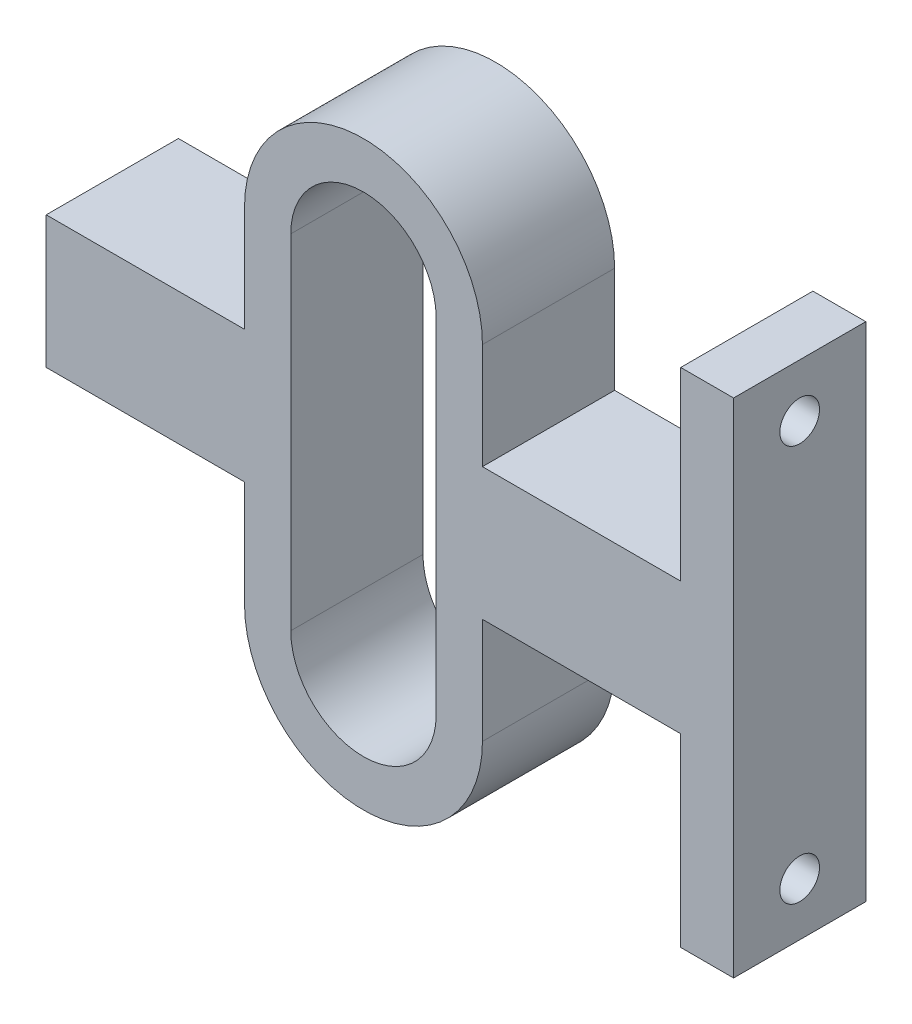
ISO-10303-21;
HEADER;
FILE_DESCRIPTION(('STEP AP214'),'2;1');
FILE_NAME('part.step','',(''),(''),'','','');
FILE_SCHEMA(('AUTOMOTIVE_DESIGN { 1 0 10303 214 1 1 1 1 }'));
ENDSEC;
DATA;
#1=APPLICATION_CONTEXT('core data for automotive mechanical design processes');
#2=APPLICATION_PROTOCOL_DEFINITION('international standard','automotive_design',2000,#1);
#3=PRODUCT_CONTEXT('',#1,'mechanical');
#4=PRODUCT('Part','Part','',(#3));
#5=PRODUCT_RELATED_PRODUCT_CATEGORY('part','',(#4));
#6=PRODUCT_DEFINITION_FORMATION('','',#4);
#7=PRODUCT_DEFINITION_CONTEXT('part definition',#1,'design');
#8=PRODUCT_DEFINITION('design','',#6,#7);
#9=PRODUCT_DEFINITION_SHAPE('','',#8);
#10=(LENGTH_UNIT() NAMED_UNIT(*) SI_UNIT(.MILLI.,.METRE.));
#11=(NAMED_UNIT(*) PLANE_ANGLE_UNIT() SI_UNIT($,.RADIAN.));
#12=(NAMED_UNIT(*) SI_UNIT($,.STERADIAN.) SOLID_ANGLE_UNIT());
#13=UNCERTAINTY_MEASURE_WITH_UNIT(LENGTH_MEASURE(1.E-05),#10,'distance_accuracy_value','');
#14=(GEOMETRIC_REPRESENTATION_CONTEXT(3) GLOBAL_UNCERTAINTY_ASSIGNED_CONTEXT((#13)) GLOBAL_UNIT_ASSIGNED_CONTEXT((#10,
#11,#12)) REPRESENTATION_CONTEXT('',''));
#15=CARTESIAN_POINT('',(0.,0.,0.));
#16=DIRECTION('',(0.,0.,1.));
#17=DIRECTION('',(1.,0.,0.));
#18=AXIS2_PLACEMENT_3D('',#15,#16,#17);
#19=CARTESIAN_POINT('',(0.,13.,10.));
#20=DIRECTION('',(0.,0.,1.));
#21=DIRECTION('',(1.,0.,0.));
#22=AXIS2_PLACEMENT_3D('',#19,#20,#21);
#23=PLANE('',#22);
#24=DIRECTION('',(0.,-1.,0.));
#25=VECTOR('',#24,1.);
#26=CARTESIAN_POINT('',(24.,-4.99999999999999,10.));
#27=LINE('',#26,#25);
#28=CARTESIAN_POINT('',(24.,-4.99999999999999,10.));
#29=VERTEX_POINT('',#28);
#30=CARTESIAN_POINT('',(24.,-18.9999999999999,10.));
#31=VERTEX_POINT('',#30);
#32=EDGE_CURVE('E234',#29,#31,#27,.T.);
#33=ORIENTED_EDGE('',*,*,#32,.T.);
#34=DIRECTION('',(1.,0.,0.));
#35=VECTOR('',#34,1.);
#36=CARTESIAN_POINT('',(24.,-18.9999999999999,10.));
#37=LINE('',#36,#35);
#38=CARTESIAN_POINT('',(28.,-18.9999999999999,10.));
#39=VERTEX_POINT('',#38);
#40=EDGE_CURVE('E238',#31,#39,#37,.T.);
#41=ORIENTED_EDGE('',*,*,#40,.T.);
#42=DIRECTION('',(0.,1.,0.));
#43=VECTOR('',#42,1.);
#44=CARTESIAN_POINT('',(28.,18.9999999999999,10.));
#45=LINE('',#44,#43);
#46=CARTESIAN_POINT('',(28.,18.9999999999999,10.));
#47=VERTEX_POINT('',#46);
#48=EDGE_CURVE('E242',#39,#47,#45,.T.);
#49=ORIENTED_EDGE('',*,*,#48,.T.);
#50=DIRECTION('',(-1.,0.,0.));
#51=VECTOR('',#50,1.);
#52=CARTESIAN_POINT('',(24.,18.9999999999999,10.));
#53=LINE('',#52,#51);
#54=CARTESIAN_POINT('',(24.,18.9999999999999,10.));
#55=VERTEX_POINT('',#54);
#56=EDGE_CURVE('E245',#47,#55,#53,.T.);
#57=ORIENTED_EDGE('',*,*,#56,.T.);
#58=DIRECTION('',(0.,-1.,0.));
#59=VECTOR('',#58,1.);
#60=CARTESIAN_POINT('',(24.,4.99999999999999,10.));
#61=LINE('',#60,#59);
#62=CARTESIAN_POINT('',(24.,4.99999999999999,10.));
#63=VERTEX_POINT('',#62);
#64=EDGE_CURVE('E248',#55,#63,#61,.T.);
#65=ORIENTED_EDGE('',*,*,#64,.T.);
#66=DIRECTION('',(-1.,0.,0.));
#67=VECTOR('',#66,1.);
#68=CARTESIAN_POINT('',(9.00000000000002,4.99999999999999,10.));
#69=LINE('',#68,#67);
#70=CARTESIAN_POINT('',(9.00000000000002,4.99999999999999,10.));
#71=VERTEX_POINT('',#70);
#72=EDGE_CURVE('E251',#63,#71,#69,.T.);
#73=ORIENTED_EDGE('',*,*,#72,.T.);
#74=DIRECTION('',(0.,1.,0.));
#75=VECTOR('',#74,1.);
#76=CARTESIAN_POINT('',(9.00000000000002,4.99999999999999,10.));
#77=LINE('',#76,#75);
#78=CARTESIAN_POINT('',(9.00000000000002,13.,10.));
#79=VERTEX_POINT('',#78);
#80=EDGE_CURVE('E254',#71,#79,#77,.T.);
#81=ORIENTED_EDGE('',*,*,#80,.T.);
#82=CARTESIAN_POINT('',(0.,13.,10.));
#83=DIRECTION('',(0.,0.,1.));
#84=DIRECTION('',(1.,0.,0.));
#85=AXIS2_PLACEMENT_3D('',#82,#83,#84);
#86=CIRCLE('',#85,9.);
#87=CARTESIAN_POINT('',(-8.99999999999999,13.,10.));
#88=VERTEX_POINT('',#87);
#89=EDGE_CURVE('E257',#79,#88,#86,.T.);
#90=ORIENTED_EDGE('',*,*,#89,.T.);
#91=DIRECTION('',(0.,-1.,0.));
#92=VECTOR('',#91,1.);
#93=CARTESIAN_POINT('',(-8.99999999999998,5.,10.));
#94=LINE('',#93,#92);
#95=CARTESIAN_POINT('',(-8.99999999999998,5.,10.));
#96=VERTEX_POINT('',#95);
#97=EDGE_CURVE('E260',#88,#96,#94,.T.);
#98=ORIENTED_EDGE('',*,*,#97,.T.);
#99=DIRECTION('',(-1.,0.,0.));
#100=VECTOR('',#99,1.);
#101=CARTESIAN_POINT('',(-8.99999999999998,5.,10.));
#102=LINE('',#101,#100);
#103=CARTESIAN_POINT('',(-24.,5.,10.));
#104=VERTEX_POINT('',#103);
#105=EDGE_CURVE('E263',#96,#104,#102,.T.);
#106=ORIENTED_EDGE('',*,*,#105,.T.);
#107=DIRECTION('',(0.,-1.,0.));
#108=VECTOR('',#107,1.);
#109=CARTESIAN_POINT('',(-24.,-5.,10.));
#110=LINE('',#109,#108);
#111=CARTESIAN_POINT('',(-24.,-5.,10.));
#112=VERTEX_POINT('',#111);
#113=EDGE_CURVE('E266',#104,#112,#110,.T.);
#114=ORIENTED_EDGE('',*,*,#113,.T.);
#115=DIRECTION('',(1.,0.,0.));
#116=VECTOR('',#115,1.);
#117=CARTESIAN_POINT('',(-8.99999999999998,-5.,10.));
#118=LINE('',#117,#116);
#119=CARTESIAN_POINT('',(-8.99999999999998,-5.,10.));
#120=VERTEX_POINT('',#119);
#121=EDGE_CURVE('E269',#112,#120,#118,.T.);
#122=ORIENTED_EDGE('',*,*,#121,.T.);
#123=DIRECTION('',(0.,-1.,0.));
#124=VECTOR('',#123,1.);
#125=CARTESIAN_POINT('',(-8.99999999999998,-13.,10.));
#126=LINE('',#125,#124);
#127=CARTESIAN_POINT('',(-8.99999999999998,-13.,10.));
#128=VERTEX_POINT('',#127);
#129=EDGE_CURVE('E272',#120,#128,#126,.T.);
#130=ORIENTED_EDGE('',*,*,#129,.T.);
#131=CARTESIAN_POINT('',(0.,-13.,10.));
#132=DIRECTION('',(0.,0.,1.));
#133=DIRECTION('',(1.,0.,0.));
#134=AXIS2_PLACEMENT_3D('',#131,#132,#133);
#135=CIRCLE('',#134,9.);
#136=CARTESIAN_POINT('',(9.00000000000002,-13.,10.));
#137=VERTEX_POINT('',#136);
#138=EDGE_CURVE('E275',#128,#137,#135,.T.);
#139=ORIENTED_EDGE('',*,*,#138,.T.);
#140=DIRECTION('',(0.,1.,0.));
#141=VECTOR('',#140,1.);
#142=CARTESIAN_POINT('',(9.00000000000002,-13.,10.));
#143=LINE('',#142,#141);
#144=CARTESIAN_POINT('',(9.00000000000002,-4.99999999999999,10.));
#145=VERTEX_POINT('',#144);
#146=EDGE_CURVE('E278',#137,#145,#143,.T.);
#147=ORIENTED_EDGE('',*,*,#146,.T.);
#148=DIRECTION('',(1.,0.,0.));
#149=VECTOR('',#148,1.);
#150=CARTESIAN_POINT('',(9.00000000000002,-4.99999999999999,10.));
#151=LINE('',#150,#149);
#152=EDGE_CURVE('E281',#145,#29,#151,.T.);
#153=ORIENTED_EDGE('',*,*,#152,.T.);
#154=EDGE_LOOP('',(#33,#41,#49,#57,#65,#73,#81,#90,#98,#106,#114,#122,#130,#139,#147,#153));
#155=FACE_BOUND('',#154,.T.);
#156=DIRECTION('',(0.,-1.,0.));
#157=VECTOR('',#156,1.);
#158=CARTESIAN_POINT('',(-5.49999999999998,13.,10.));
#159=LINE('',#158,#157);
#160=CARTESIAN_POINT('',(-5.49999999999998,13.,10.));
#161=VERTEX_POINT('',#160);
#162=CARTESIAN_POINT('',(-5.49999999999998,-13.,10.));
#163=VERTEX_POINT('',#162);
#164=EDGE_CURVE('E193',#161,#163,#159,.T.);
#165=ORIENTED_EDGE('',*,*,#164,.F.);
#166=CARTESIAN_POINT('',(0.,13.,10.));
#167=DIRECTION('',(0.,0.,1.));
#168=DIRECTION('',(1.,0.,0.));
#169=AXIS2_PLACEMENT_3D('',#166,#167,#168);
#170=CIRCLE('',#169,5.5);
#171=CARTESIAN_POINT('',(5.50000000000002,13.,10.));
#172=VERTEX_POINT('',#171);
#173=EDGE_CURVE('E184',#172,#161,#170,.T.);
#174=ORIENTED_EDGE('',*,*,#173,.F.);
#175=DIRECTION('',(0.,1.,0.));
#176=VECTOR('',#175,1.);
#177=CARTESIAN_POINT('',(5.50000000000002,13.,10.));
#178=LINE('',#177,#176);
#179=CARTESIAN_POINT('',(5.50000000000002,-13.,10.));
#180=VERTEX_POINT('',#179);
#181=EDGE_CURVE('E210',#180,#172,#178,.T.);
#182=ORIENTED_EDGE('',*,*,#181,.F.);
#183=CARTESIAN_POINT('',(0.,-13.,10.));
#184=DIRECTION('',(0.,0.,1.));
#185=DIRECTION('',(-1.,0.,0.));
#186=AXIS2_PLACEMENT_3D('',#183,#184,#185);
#187=CIRCLE('',#186,5.5);
#188=EDGE_CURVE('E206',#163,#180,#187,.T.);
#189=ORIENTED_EDGE('',*,*,#188,.F.);
#190=EDGE_LOOP('',(#165,#174,#182,#189));
#191=FACE_BOUND('',#190,.T.);
#192=ADVANCED_FACE('F45',(#155,#191),#23,.T.);
#193=CARTESIAN_POINT('',(0.,13.,0.));
#194=DIRECTION('',(0.,0.,1.));
#195=DIRECTION('',(1.,0.,0.));
#196=AXIS2_PLACEMENT_3D('',#193,#194,#195);
#197=PLANE('',#196);
#198=DIRECTION('',(0.,-1.,0.));
#199=VECTOR('',#198,1.);
#200=CARTESIAN_POINT('',(24.,-4.99999999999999,0.));
#201=LINE('',#200,#199);
#202=CARTESIAN_POINT('',(24.,-4.99999999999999,0.));
#203=VERTEX_POINT('',#202);
#204=CARTESIAN_POINT('',(24.,-18.9999999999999,0.));
#205=VERTEX_POINT('',#204);
#206=EDGE_CURVE('E202',#203,#205,#201,.T.);
#207=ORIENTED_EDGE('',*,*,#206,.F.);
#208=DIRECTION('',(1.,0.,0.));
#209=VECTOR('',#208,1.);
#210=CARTESIAN_POINT('',(9.00000000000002,-4.99999999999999,0.));
#211=LINE('',#210,#209);
#212=CARTESIAN_POINT('',(9.00000000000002,-4.99999999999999,0.));
#213=VERTEX_POINT('',#212);
#214=EDGE_CURVE('E239',#213,#203,#211,.T.);
#215=ORIENTED_EDGE('',*,*,#214,.F.);
#216=DIRECTION('',(0.,1.,0.));
#217=VECTOR('',#216,1.);
#218=CARTESIAN_POINT('',(9.00000000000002,-13.,0.));
#219=LINE('',#218,#217);
#220=CARTESIAN_POINT('',(9.00000000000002,-13.,0.));
#221=VERTEX_POINT('',#220);
#222=EDGE_CURVE('E327',#221,#213,#219,.T.);
#223=ORIENTED_EDGE('',*,*,#222,.F.);
#224=CARTESIAN_POINT('',(0.,-13.,0.));
#225=DIRECTION('',(0.,0.,1.));
#226=DIRECTION('',(1.,0.,0.));
#227=AXIS2_PLACEMENT_3D('',#224,#225,#226);
#228=CIRCLE('',#227,9.);
#229=CARTESIAN_POINT('',(-8.99999999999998,-13.,0.));
#230=VERTEX_POINT('',#229);
#231=EDGE_CURVE('E324',#230,#221,#228,.T.);
#232=ORIENTED_EDGE('',*,*,#231,.F.);
#233=DIRECTION('',(0.,-1.,0.));
#234=VECTOR('',#233,1.);
#235=CARTESIAN_POINT('',(-8.99999999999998,-13.,0.));
#236=LINE('',#235,#234);
#237=CARTESIAN_POINT('',(-8.99999999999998,-5.,0.));
#238=VERTEX_POINT('',#237);
#239=EDGE_CURVE('E321',#238,#230,#236,.T.);
#240=ORIENTED_EDGE('',*,*,#239,.F.);
#241=DIRECTION('',(1.,0.,0.));
#242=VECTOR('',#241,1.);
#243=CARTESIAN_POINT('',(-8.99999999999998,-5.,0.));
#244=LINE('',#243,#242);
#245=CARTESIAN_POINT('',(-24.,-5.,0.));
#246=VERTEX_POINT('',#245);
#247=EDGE_CURVE('E318',#246,#238,#244,.T.);
#248=ORIENTED_EDGE('',*,*,#247,.F.);
#249=DIRECTION('',(0.,-1.,0.));
#250=VECTOR('',#249,1.);
#251=CARTESIAN_POINT('',(-24.,-5.,0.));
#252=LINE('',#251,#250);
#253=CARTESIAN_POINT('',(-24.,5.,0.));
#254=VERTEX_POINT('',#253);
#255=EDGE_CURVE('E315',#254,#246,#252,.T.);
#256=ORIENTED_EDGE('',*,*,#255,.F.);
#257=DIRECTION('',(-1.,0.,0.));
#258=VECTOR('',#257,1.);
#259=CARTESIAN_POINT('',(-8.99999999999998,5.,0.));
#260=LINE('',#259,#258);
#261=CARTESIAN_POINT('',(-8.99999999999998,5.,0.));
#262=VERTEX_POINT('',#261);
#263=EDGE_CURVE('E312',#262,#254,#260,.T.);
#264=ORIENTED_EDGE('',*,*,#263,.F.);
#265=DIRECTION('',(0.,-1.,0.));
#266=VECTOR('',#265,1.);
#267=CARTESIAN_POINT('',(-8.99999999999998,5.,0.));
#268=LINE('',#267,#266);
#269=CARTESIAN_POINT('',(-8.99999999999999,13.,0.));
#270=VERTEX_POINT('',#269);
#271=EDGE_CURVE('E309',#270,#262,#268,.T.);
#272=ORIENTED_EDGE('',*,*,#271,.F.);
#273=CARTESIAN_POINT('',(0.,13.,0.));
#274=DIRECTION('',(0.,0.,1.));
#275=DIRECTION('',(1.,0.,0.));
#276=AXIS2_PLACEMENT_3D('',#273,#274,#275);
#277=CIRCLE('',#276,9.);
#278=CARTESIAN_POINT('',(9.00000000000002,13.,0.));
#279=VERTEX_POINT('',#278);
#280=EDGE_CURVE('E306',#279,#270,#277,.T.);
#281=ORIENTED_EDGE('',*,*,#280,.F.);
#282=DIRECTION('',(0.,1.,0.));
#283=VECTOR('',#282,1.);
#284=CARTESIAN_POINT('',(9.00000000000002,4.99999999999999,0.));
#285=LINE('',#284,#283);
#286=CARTESIAN_POINT('',(9.00000000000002,4.99999999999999,0.));
#287=VERTEX_POINT('',#286);
#288=EDGE_CURVE('E303',#287,#279,#285,.T.);
#289=ORIENTED_EDGE('',*,*,#288,.F.);
#290=DIRECTION('',(-1.,0.,0.));
#291=VECTOR('',#290,1.);
#292=CARTESIAN_POINT('',(9.00000000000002,4.99999999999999,0.));
#293=LINE('',#292,#291);
#294=CARTESIAN_POINT('',(24.,4.99999999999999,0.));
#295=VERTEX_POINT('',#294);
#296=EDGE_CURVE('E300',#295,#287,#293,.T.);
#297=ORIENTED_EDGE('',*,*,#296,.F.);
#298=DIRECTION('',(0.,-1.,0.));
#299=VECTOR('',#298,1.);
#300=CARTESIAN_POINT('',(24.,4.99999999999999,0.));
#301=LINE('',#300,#299);
#302=CARTESIAN_POINT('',(24.,18.9999999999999,0.));
#303=VERTEX_POINT('',#302);
#304=EDGE_CURVE('E297',#303,#295,#301,.T.);
#305=ORIENTED_EDGE('',*,*,#304,.F.);
#306=DIRECTION('',(-1.,0.,0.));
#307=VECTOR('',#306,1.);
#308=CARTESIAN_POINT('',(24.,18.9999999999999,0.));
#309=LINE('',#308,#307);
#310=CARTESIAN_POINT('',(28.,18.9999999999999,0.));
#311=VERTEX_POINT('',#310);
#312=EDGE_CURVE('E294',#311,#303,#309,.T.);
#313=ORIENTED_EDGE('',*,*,#312,.F.);
#314=DIRECTION('',(0.,1.,0.));
#315=VECTOR('',#314,1.);
#316=CARTESIAN_POINT('',(28.,18.9999999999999,0.));
#317=LINE('',#316,#315);
#318=CARTESIAN_POINT('',(28.,-18.9999999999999,0.));
#319=VERTEX_POINT('',#318);
#320=EDGE_CURVE('E291',#319,#311,#317,.T.);
#321=ORIENTED_EDGE('',*,*,#320,.F.);
#322=DIRECTION('',(1.,0.,0.));
#323=VECTOR('',#322,1.);
#324=CARTESIAN_POINT('',(24.,-18.9999999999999,0.));
#325=LINE('',#324,#323);
#326=EDGE_CURVE('E288',#205,#319,#325,.T.);
#327=ORIENTED_EDGE('',*,*,#326,.F.);
#328=EDGE_LOOP('',(#207,#215,#223,#232,#240,#248,#256,#264,#272,#281,#289,#297,#305,#313,#321,#327));
#329=FACE_BOUND('',#328,.T.);
#330=CARTESIAN_POINT('',(0.,13.,0.));
#331=DIRECTION('',(0.,0.,1.));
#332=DIRECTION('',(1.,0.,0.));
#333=AXIS2_PLACEMENT_3D('',#330,#331,#332);
#334=CIRCLE('',#333,5.5);
#335=CARTESIAN_POINT('',(5.50000000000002,13.,0.));
#336=VERTEX_POINT('',#335);
#337=CARTESIAN_POINT('',(-5.49999999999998,13.,0.));
#338=VERTEX_POINT('',#337);
#339=EDGE_CURVE('E70',#336,#338,#334,.T.);
#340=ORIENTED_EDGE('',*,*,#339,.T.);
#341=DIRECTION('',(0.,-1.,0.));
#342=VECTOR('',#341,1.);
#343=CARTESIAN_POINT('',(-5.49999999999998,13.,0.));
#344=LINE('',#343,#342);
#345=CARTESIAN_POINT('',(-5.49999999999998,-13.,0.));
#346=VERTEX_POINT('',#345);
#347=EDGE_CURVE('E200',#338,#346,#344,.T.);
#348=ORIENTED_EDGE('',*,*,#347,.T.);
#349=CARTESIAN_POINT('',(0.,-13.,0.));
#350=DIRECTION('',(0.,0.,1.));
#351=DIRECTION('',(-1.,0.,0.));
#352=AXIS2_PLACEMENT_3D('',#349,#350,#351);
#353=CIRCLE('',#352,5.5);
#354=CARTESIAN_POINT('',(5.50000000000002,-13.,0.));
#355=VERTEX_POINT('',#354);
#356=EDGE_CURVE('E221',#346,#355,#353,.T.);
#357=ORIENTED_EDGE('',*,*,#356,.T.);
#358=DIRECTION('',(0.,1.,0.));
#359=VECTOR('',#358,1.);
#360=CARTESIAN_POINT('',(5.50000000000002,13.,0.));
#361=LINE('',#360,#359);
#362=EDGE_CURVE('E194',#355,#336,#361,.T.);
#363=ORIENTED_EDGE('',*,*,#362,.T.);
#364=EDGE_LOOP('',(#340,#348,#357,#363));
#365=FACE_BOUND('',#364,.T.);
#366=ADVANCED_FACE('F399',(#329,#365),#197,.F.);
#367=CARTESIAN_POINT('',(24.,-4.99999999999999,10.));
#368=DIRECTION('',(1.,0.,0.));
#369=DIRECTION('',(0.,0.,-1.));
#370=AXIS2_PLACEMENT_3D('',#367,#368,#369);
#371=PLANE('',#370);
#372=CARTESIAN_POINT('',(24.,-14.9999999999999,5.));
#373=DIRECTION('',(1.,0.,0.));
#374=DIRECTION('',(0.,0.,-1.));
#375=AXIS2_PLACEMENT_3D('',#372,#373,#374);
#376=CIRCLE('',#375,1.5);
#377=CARTESIAN_POINT('',(24.,-14.9999999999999,3.5));
#378=VERTEX_POINT('',#377);
#379=EDGE_CURVE('E218',#378,#378,#376,.T.);
#380=ORIENTED_EDGE('',*,*,#379,.T.);
#381=EDGE_LOOP('',(#380));
#382=FACE_BOUND('',#381,.T.);
#383=ORIENTED_EDGE('',*,*,#206,.T.);
#384=DIRECTION('',(0.,0.,-1.));
#385=VECTOR('',#384,1.);
#386=CARTESIAN_POINT('',(24.,-18.9999999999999,10.));
#387=LINE('',#386,#385);
#388=EDGE_CURVE('E11',#31,#205,#387,.T.);
#389=ORIENTED_EDGE('',*,*,#388,.F.);
#390=ORIENTED_EDGE('',*,*,#32,.F.);
#391=DIRECTION('',(0.,0.,-1.));
#392=VECTOR('',#391,1.);
#393=CARTESIAN_POINT('',(24.,-4.99999999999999,10.));
#394=LINE('',#393,#392);
#395=EDGE_CURVE('E284',#29,#203,#394,.T.);
#396=ORIENTED_EDGE('',*,*,#395,.T.);
#397=EDGE_LOOP('',(#383,#389,#390,#396));
#398=FACE_BOUND('',#397,.T.);
#399=ADVANCED_FACE('F47',(#382,#398),#371,.F.);
#400=CARTESIAN_POINT('',(24.,-18.9999999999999,10.));
#401=DIRECTION('',(0.,1.,0.));
#402=DIRECTION('',(0.,0.,1.));
#403=AXIS2_PLACEMENT_3D('',#400,#401,#402);
#404=PLANE('',#403);
#405=ORIENTED_EDGE('',*,*,#326,.T.);
#406=DIRECTION('',(0.,0.,-1.));
#407=VECTOR('',#406,1.);
#408=CARTESIAN_POINT('',(28.,-18.9999999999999,10.));
#409=LINE('',#408,#407);
#410=EDGE_CURVE('E55',#39,#319,#409,.T.);
#411=ORIENTED_EDGE('',*,*,#410,.F.);
#412=ORIENTED_EDGE('',*,*,#40,.F.);
#413=ORIENTED_EDGE('',*,*,#388,.T.);
#414=EDGE_LOOP('',(#405,#411,#412,#413));
#415=FACE_BOUND('',#414,.T.);
#416=ADVANCED_FACE('F416',(#415),#404,.F.);
#417=CARTESIAN_POINT('',(28.,18.9999999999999,10.));
#418=DIRECTION('',(-1.,0.,0.));
#419=DIRECTION('',(0.,0.,1.));
#420=AXIS2_PLACEMENT_3D('',#417,#418,#419);
#421=PLANE('',#420);
#422=CARTESIAN_POINT('',(28.,14.9999999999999,5.));
#423=DIRECTION('',(1.,0.,0.));
#424=DIRECTION('',(0.,0.,-1.));
#425=AXIS2_PLACEMENT_3D('',#422,#423,#424);
#426=CIRCLE('',#425,1.5);
#427=CARTESIAN_POINT('',(28.,14.9999999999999,3.5));
#428=VERTEX_POINT('',#427);
#429=EDGE_CURVE('E679',#428,#428,#426,.T.);
#430=ORIENTED_EDGE('',*,*,#429,.F.);
#431=EDGE_LOOP('',(#430));
#432=FACE_BOUND('',#431,.T.);
#433=CARTESIAN_POINT('',(28.,-14.9999999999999,5.));
#434=DIRECTION('',(1.,0.,0.));
#435=DIRECTION('',(0.,0.,1.));
#436=AXIS2_PLACEMENT_3D('',#433,#434,#435);
#437=CIRCLE('',#436,1.5);
#438=CARTESIAN_POINT('',(28.,-14.9999999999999,6.5));
#439=VERTEX_POINT('',#438);
#440=EDGE_CURVE('E673',#439,#439,#437,.T.);
#441=ORIENTED_EDGE('',*,*,#440,.F.);
#442=EDGE_LOOP('',(#441));
#443=FACE_BOUND('',#442,.T.);
#444=ORIENTED_EDGE('',*,*,#320,.T.);
#445=DIRECTION('',(0.,0.,-1.));
#446=VECTOR('',#445,1.);
#447=CARTESIAN_POINT('',(28.,18.9999999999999,10.));
#448=LINE('',#447,#446);
#449=EDGE_CURVE('E383',#47,#311,#448,.T.);
#450=ORIENTED_EDGE('',*,*,#449,.F.);
#451=ORIENTED_EDGE('',*,*,#48,.F.);
#452=ORIENTED_EDGE('',*,*,#410,.T.);
#453=EDGE_LOOP('',(#444,#450,#451,#452));
#454=FACE_BOUND('',#453,.T.);
#455=ADVANCED_FACE('F393',(#432,#443,#454),#421,.F.);
#456=CARTESIAN_POINT('',(24.,18.9999999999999,10.));
#457=DIRECTION('',(0.,-1.,0.));
#458=DIRECTION('',(0.,0.,-1.));
#459=AXIS2_PLACEMENT_3D('',#456,#457,#458);
#460=PLANE('',#459);
#461=ORIENTED_EDGE('',*,*,#312,.T.);
#462=DIRECTION('',(0.,0.,-1.));
#463=VECTOR('',#462,1.);
#464=CARTESIAN_POINT('',(24.,18.9999999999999,10.));
#465=LINE('',#464,#463);
#466=EDGE_CURVE('E379',#55,#303,#465,.T.);
#467=ORIENTED_EDGE('',*,*,#466,.F.);
#468=ORIENTED_EDGE('',*,*,#56,.F.);
#469=ORIENTED_EDGE('',*,*,#449,.T.);
#470=EDGE_LOOP('',(#461,#467,#468,#469));
#471=FACE_BOUND('',#470,.T.);
#472=ADVANCED_FACE('F405',(#471),#460,.F.);
#473=CARTESIAN_POINT('',(24.,4.99999999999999,10.));
#474=DIRECTION('',(1.,0.,0.));
#475=DIRECTION('',(0.,0.,-1.));
#476=AXIS2_PLACEMENT_3D('',#473,#474,#475);
#477=PLANE('',#476);
#478=CARTESIAN_POINT('',(24.,14.9999999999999,5.));
#479=DIRECTION('',(1.,0.,0.));
#480=DIRECTION('',(0.,0.,-1.));
#481=AXIS2_PLACEMENT_3D('',#478,#479,#480);
#482=CIRCLE('',#481,1.5);
#483=CARTESIAN_POINT('',(24.,14.9999999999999,3.5));
#484=VERTEX_POINT('',#483);
#485=EDGE_CURVE('E49',#484,#484,#482,.T.);
#486=ORIENTED_EDGE('',*,*,#485,.T.);
#487=EDGE_LOOP('',(#486));
#488=FACE_BOUND('',#487,.T.);
#489=ORIENTED_EDGE('',*,*,#304,.T.);
#490=DIRECTION('',(0.,0.,-1.));
#491=VECTOR('',#490,1.);
#492=CARTESIAN_POINT('',(24.,4.99999999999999,10.));
#493=LINE('',#492,#491);
#494=EDGE_CURVE('E375',#63,#295,#493,.T.);
#495=ORIENTED_EDGE('',*,*,#494,.F.);
#496=ORIENTED_EDGE('',*,*,#64,.F.);
#497=ORIENTED_EDGE('',*,*,#466,.T.);
#498=EDGE_LOOP('',(#489,#495,#496,#497));
#499=FACE_BOUND('',#498,.T.);
#500=ADVANCED_FACE('F409',(#488,#499),#477,.F.);
#501=CARTESIAN_POINT('',(9.00000000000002,4.99999999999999,10.));
#502=DIRECTION('',(0.,-1.,0.));
#503=DIRECTION('',(0.,0.,-1.));
#504=AXIS2_PLACEMENT_3D('',#501,#502,#503);
#505=PLANE('',#504);
#506=ORIENTED_EDGE('',*,*,#296,.T.);
#507=DIRECTION('',(0.,0.,-1.));
#508=VECTOR('',#507,1.);
#509=CARTESIAN_POINT('',(9.00000000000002,4.99999999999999,10.));
#510=LINE('',#509,#508);
#511=EDGE_CURVE('E371',#71,#287,#510,.T.);
#512=ORIENTED_EDGE('',*,*,#511,.F.);
#513=ORIENTED_EDGE('',*,*,#72,.F.);
#514=ORIENTED_EDGE('',*,*,#494,.T.);
#515=EDGE_LOOP('',(#506,#512,#513,#514));
#516=FACE_BOUND('',#515,.T.);
#517=ADVANCED_FACE('F469',(#516),#505,.F.);
#518=CARTESIAN_POINT('',(9.00000000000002,4.99999999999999,10.));
#519=DIRECTION('',(-1.,0.,0.));
#520=DIRECTION('',(0.,-1.,0.));
#521=AXIS2_PLACEMENT_3D('',#518,#519,#520);
#522=PLANE('',#521);
#523=ORIENTED_EDGE('',*,*,#288,.T.);
#524=DIRECTION('',(0.,0.,-1.));
#525=VECTOR('',#524,1.);
#526=CARTESIAN_POINT('',(9.00000000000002,13.,10.));
#527=LINE('',#526,#525);
#528=EDGE_CURVE('E367',#79,#279,#527,.T.);
#529=ORIENTED_EDGE('',*,*,#528,.F.);
#530=ORIENTED_EDGE('',*,*,#80,.F.);
#531=ORIENTED_EDGE('',*,*,#511,.T.);
#532=EDGE_LOOP('',(#523,#529,#530,#531));
#533=FACE_BOUND('',#532,.T.);
#534=ADVANCED_FACE('F466',(#533),#522,.F.);
#535=CARTESIAN_POINT('',(0.,13.,10.));
#536=DIRECTION('',(0.,0.,-1.));
#537=DIRECTION('',(-1.,0.,0.));
#538=AXIS2_PLACEMENT_3D('',#535,#536,#537);
#539=CYLINDRICAL_SURFACE('',#538,9.);
#540=ORIENTED_EDGE('',*,*,#280,.T.);
#541=DIRECTION('',(0.,0.,-1.));
#542=VECTOR('',#541,1.);
#543=CARTESIAN_POINT('',(-8.99999999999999,13.,10.));
#544=LINE('',#543,#542);
#545=EDGE_CURVE('E363',#88,#270,#544,.T.);
#546=ORIENTED_EDGE('',*,*,#545,.F.);
#547=ORIENTED_EDGE('',*,*,#89,.F.);
#548=ORIENTED_EDGE('',*,*,#528,.T.);
#549=EDGE_LOOP('',(#540,#546,#547,#548));
#550=FACE_BOUND('',#549,.T.);
#551=ADVANCED_FACE('F462',(#550),#539,.T.);
#552=CARTESIAN_POINT('',(-8.99999999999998,5.,10.));
#553=DIRECTION('',(1.,0.,0.));
#554=DIRECTION('',(0.,0.,-1.));
#555=AXIS2_PLACEMENT_3D('',#552,#553,#554);
#556=PLANE('',#555);
#557=ORIENTED_EDGE('',*,*,#271,.T.);
#558=DIRECTION('',(0.,0.,-1.));
#559=VECTOR('',#558,1.);
#560=CARTESIAN_POINT('',(-8.99999999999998,5.,10.));
#561=LINE('',#560,#559);
#562=EDGE_CURVE('E359',#96,#262,#561,.T.);
#563=ORIENTED_EDGE('',*,*,#562,.F.);
#564=ORIENTED_EDGE('',*,*,#97,.F.);
#565=ORIENTED_EDGE('',*,*,#545,.T.);
#566=EDGE_LOOP('',(#557,#563,#564,#565));
#567=FACE_BOUND('',#566,.T.);
#568=ADVANCED_FACE('F458',(#567),#556,.F.);
#569=CARTESIAN_POINT('',(-8.99999999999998,5.,10.));
#570=DIRECTION('',(0.,-1.,0.));
#571=DIRECTION('',(0.,0.,-1.));
#572=AXIS2_PLACEMENT_3D('',#569,#570,#571);
#573=PLANE('',#572);
#574=ORIENTED_EDGE('',*,*,#263,.T.);
#575=DIRECTION('',(0.,0.,-1.));
#576=VECTOR('',#575,1.);
#577=CARTESIAN_POINT('',(-24.,5.,10.));
#578=LINE('',#577,#576);
#579=EDGE_CURVE('E355',#104,#254,#578,.T.);
#580=ORIENTED_EDGE('',*,*,#579,.F.);
#581=ORIENTED_EDGE('',*,*,#105,.F.);
#582=ORIENTED_EDGE('',*,*,#562,.T.);
#583=EDGE_LOOP('',(#574,#580,#581,#582));
#584=FACE_BOUND('',#583,.T.);
#585=ADVANCED_FACE('F453',(#584),#573,.F.);
#586=CARTESIAN_POINT('',(-24.,-5.,10.));
#587=DIRECTION('',(1.,0.,0.));
#588=DIRECTION('',(0.,0.,-1.));
#589=AXIS2_PLACEMENT_3D('',#586,#587,#588);
#590=PLANE('',#589);
#591=ORIENTED_EDGE('',*,*,#255,.T.);
#592=DIRECTION('',(0.,0.,-1.));
#593=VECTOR('',#592,1.);
#594=CARTESIAN_POINT('',(-24.,-5.,10.));
#595=LINE('',#594,#593);
#596=EDGE_CURVE('E351',#112,#246,#595,.T.);
#597=ORIENTED_EDGE('',*,*,#596,.F.);
#598=ORIENTED_EDGE('',*,*,#113,.F.);
#599=ORIENTED_EDGE('',*,*,#579,.T.);
#600=EDGE_LOOP('',(#591,#597,#598,#599));
#601=FACE_BOUND('',#600,.T.);
#602=ADVANCED_FACE('F447',(#601),#590,.F.);
#603=CARTESIAN_POINT('',(-8.99999999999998,-5.,10.));
#604=DIRECTION('',(0.,1.,0.));
#605=DIRECTION('',(0.,0.,1.));
#606=AXIS2_PLACEMENT_3D('',#603,#604,#605);
#607=PLANE('',#606);
#608=ORIENTED_EDGE('',*,*,#247,.T.);
#609=DIRECTION('',(0.,0.,-1.));
#610=VECTOR('',#609,1.);
#611=CARTESIAN_POINT('',(-8.99999999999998,-5.,10.));
#612=LINE('',#611,#610);
#613=EDGE_CURVE('E347',#120,#238,#612,.T.);
#614=ORIENTED_EDGE('',*,*,#613,.F.);
#615=ORIENTED_EDGE('',*,*,#121,.F.);
#616=ORIENTED_EDGE('',*,*,#596,.T.);
#617=EDGE_LOOP('',(#608,#614,#615,#616));
#618=FACE_BOUND('',#617,.T.);
#619=ADVANCED_FACE('F443',(#618),#607,.F.);
#620=CARTESIAN_POINT('',(-8.99999999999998,-13.,10.));
#621=DIRECTION('',(1.,0.,0.));
#622=DIRECTION('',(0.,0.,-1.));
#623=AXIS2_PLACEMENT_3D('',#620,#621,#622);
#624=PLANE('',#623);
#625=ORIENTED_EDGE('',*,*,#239,.T.);
#626=DIRECTION('',(0.,0.,-1.));
#627=VECTOR('',#626,1.);
#628=CARTESIAN_POINT('',(-8.99999999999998,-13.,10.));
#629=LINE('',#628,#627);
#630=EDGE_CURVE('E343',#128,#230,#629,.T.);
#631=ORIENTED_EDGE('',*,*,#630,.F.);
#632=ORIENTED_EDGE('',*,*,#129,.F.);
#633=ORIENTED_EDGE('',*,*,#613,.T.);
#634=EDGE_LOOP('',(#625,#631,#632,#633));
#635=FACE_BOUND('',#634,.T.);
#636=ADVANCED_FACE('F438',(#635),#624,.F.);
#637=CARTESIAN_POINT('',(0.,-13.,10.));
#638=DIRECTION('',(0.,0.,-1.));
#639=DIRECTION('',(-1.,0.,0.));
#640=AXIS2_PLACEMENT_3D('',#637,#638,#639);
#641=CYLINDRICAL_SURFACE('',#640,9.);
#642=ORIENTED_EDGE('',*,*,#231,.T.);
#643=DIRECTION('',(0.,0.,-1.));
#644=VECTOR('',#643,1.);
#645=CARTESIAN_POINT('',(9.00000000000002,-13.,10.));
#646=LINE('',#645,#644);
#647=EDGE_CURVE('E339',#137,#221,#646,.T.);
#648=ORIENTED_EDGE('',*,*,#647,.F.);
#649=ORIENTED_EDGE('',*,*,#138,.F.);
#650=ORIENTED_EDGE('',*,*,#630,.T.);
#651=EDGE_LOOP('',(#642,#648,#649,#650));
#652=FACE_BOUND('',#651,.T.);
#653=ADVANCED_FACE('F432',(#652),#641,.T.);
#654=CARTESIAN_POINT('',(9.00000000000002,-13.,10.));
#655=DIRECTION('',(-1.,0.,0.));
#656=DIRECTION('',(0.,-1.,0.));
#657=AXIS2_PLACEMENT_3D('',#654,#655,#656);
#658=PLANE('',#657);
#659=ORIENTED_EDGE('',*,*,#222,.T.);
#660=DIRECTION('',(0.,0.,-1.));
#661=VECTOR('',#660,1.);
#662=CARTESIAN_POINT('',(9.00000000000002,-4.99999999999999,10.));
#663=LINE('',#662,#661);
#664=EDGE_CURVE('E335',#145,#213,#663,.T.);
#665=ORIENTED_EDGE('',*,*,#664,.F.);
#666=ORIENTED_EDGE('',*,*,#146,.F.);
#667=ORIENTED_EDGE('',*,*,#647,.T.);
#668=EDGE_LOOP('',(#659,#665,#666,#667));
#669=FACE_BOUND('',#668,.T.);
#670=ADVANCED_FACE('F428',(#669),#658,.F.);
#671=CARTESIAN_POINT('',(9.00000000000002,-4.99999999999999,10.));
#672=DIRECTION('',(0.,1.,0.));
#673=DIRECTION('',(0.,0.,1.));
#674=AXIS2_PLACEMENT_3D('',#671,#672,#673);
#675=PLANE('',#674);
#676=ORIENTED_EDGE('',*,*,#214,.T.);
#677=ORIENTED_EDGE('',*,*,#395,.F.);
#678=ORIENTED_EDGE('',*,*,#152,.F.);
#679=ORIENTED_EDGE('',*,*,#664,.T.);
#680=EDGE_LOOP('',(#676,#677,#678,#679));
#681=FACE_BOUND('',#680,.T.);
#682=ADVANCED_FACE('F423',(#681),#675,.F.);
#683=CARTESIAN_POINT('',(0.,13.,10.));
#684=DIRECTION('',(0.,0.,-1.));
#685=DIRECTION('',(-1.,0.,0.));
#686=AXIS2_PLACEMENT_3D('',#683,#684,#685);
#687=CYLINDRICAL_SURFACE('',#686,5.5);
#688=ORIENTED_EDGE('',*,*,#339,.F.);
#689=DIRECTION('',(0.,0.,-1.));
#690=VECTOR('',#689,1.);
#691=CARTESIAN_POINT('',(5.50000000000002,13.,10.));
#692=LINE('',#691,#690);
#693=EDGE_CURVE('E188',#172,#336,#692,.T.);
#694=ORIENTED_EDGE('',*,*,#693,.F.);
#695=ORIENTED_EDGE('',*,*,#173,.T.);
#696=DIRECTION('',(0.,0.,-1.));
#697=VECTOR('',#696,1.);
#698=CARTESIAN_POINT('',(-5.49999999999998,13.,10.));
#699=LINE('',#698,#697);
#700=EDGE_CURVE('E187',#161,#338,#699,.T.);
#701=ORIENTED_EDGE('',*,*,#700,.T.);
#702=EDGE_LOOP('',(#688,#694,#695,#701));
#703=FACE_BOUND('',#702,.T.);
#704=ADVANCED_FACE('F186',(#703),#687,.F.);
#705=CARTESIAN_POINT('',(-5.49999999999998,13.,10.));
#706=DIRECTION('',(1.,0.,0.));
#707=DIRECTION('',(0.,1.,0.));
#708=AXIS2_PLACEMENT_3D('',#705,#706,#707);
#709=PLANE('',#708);
#710=ORIENTED_EDGE('',*,*,#347,.F.);
#711=ORIENTED_EDGE('',*,*,#700,.F.);
#712=ORIENTED_EDGE('',*,*,#164,.T.);
#713=DIRECTION('',(0.,0.,-1.));
#714=VECTOR('',#713,1.);
#715=CARTESIAN_POINT('',(-5.49999999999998,-13.,10.));
#716=LINE('',#715,#714);
#717=EDGE_CURVE('E203',#163,#346,#716,.T.);
#718=ORIENTED_EDGE('',*,*,#717,.T.);
#719=EDGE_LOOP('',(#710,#711,#712,#718));
#720=FACE_BOUND('',#719,.T.);
#721=ADVANCED_FACE('F197',(#720),#709,.T.);
#722=CARTESIAN_POINT('',(0.,-13.,10.));
#723=DIRECTION('',(0.,0.,-1.));
#724=DIRECTION('',(-1.,0.,0.));
#725=AXIS2_PLACEMENT_3D('',#722,#723,#724);
#726=CYLINDRICAL_SURFACE('',#725,5.5);
#727=ORIENTED_EDGE('',*,*,#356,.F.);
#728=ORIENTED_EDGE('',*,*,#717,.F.);
#729=ORIENTED_EDGE('',*,*,#188,.T.);
#730=DIRECTION('',(0.,0.,-1.));
#731=VECTOR('',#730,1.);
#732=CARTESIAN_POINT('',(5.50000000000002,-13.,10.));
#733=LINE('',#732,#731);
#734=EDGE_CURVE('E62',#180,#355,#733,.T.);
#735=ORIENTED_EDGE('',*,*,#734,.T.);
#736=EDGE_LOOP('',(#727,#728,#729,#735));
#737=FACE_BOUND('',#736,.T.);
#738=ADVANCED_FACE('F563',(#737),#726,.F.);
#739=CARTESIAN_POINT('',(5.50000000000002,13.,10.));
#740=DIRECTION('',(-1.,0.,0.));
#741=DIRECTION('',(0.,-1.,0.));
#742=AXIS2_PLACEMENT_3D('',#739,#740,#741);
#743=PLANE('',#742);
#744=ORIENTED_EDGE('',*,*,#362,.F.);
#745=ORIENTED_EDGE('',*,*,#734,.F.);
#746=ORIENTED_EDGE('',*,*,#181,.T.);
#747=ORIENTED_EDGE('',*,*,#693,.T.);
#748=EDGE_LOOP('',(#744,#745,#746,#747));
#749=FACE_BOUND('',#748,.T.);
#750=ADVANCED_FACE('F570',(#749),#743,.T.);
#751=CARTESIAN_POINT('',(18.,14.9999999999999,5.));
#752=DIRECTION('',(1.,0.,0.));
#753=DIRECTION('',(0.,0.,-1.));
#754=AXIS2_PLACEMENT_3D('',#751,#752,#753);
#755=CYLINDRICAL_SURFACE('',#754,1.5);
#756=ORIENTED_EDGE('',*,*,#429,.T.);
#757=EDGE_LOOP('',(#756));
#758=FACE_BOUND('',#757,.T.);
#759=ORIENTED_EDGE('',*,*,#485,.F.);
#760=EDGE_LOOP('',(#759));
#761=FACE_BOUND('',#760,.T.);
#762=ADVANCED_FACE('F579',(#758,#761),#755,.F.);
#763=CARTESIAN_POINT('',(18.,-14.9999999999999,5.));
#764=DIRECTION('',(1.,0.,0.));
#765=DIRECTION('',(0.,0.,-1.));
#766=AXIS2_PLACEMENT_3D('',#763,#764,#765);
#767=CYLINDRICAL_SURFACE('',#766,1.5);
#768=ORIENTED_EDGE('',*,*,#440,.T.);
#769=EDGE_LOOP('',(#768));
#770=FACE_BOUND('',#769,.T.);
#771=ORIENTED_EDGE('',*,*,#379,.F.);
#772=EDGE_LOOP('',(#771));
#773=FACE_BOUND('',#772,.T.);
#774=ADVANCED_FACE('F610',(#770,#773),#767,.F.);
#775=CLOSED_SHELL('',(#192,#366,#399,#416,#455,#472,#500,#517,#534,#551,#568,#585,#602,#619,
#636,#653,#670,#682,#704,#721,#738,#750,#762,#774));
#776=MANIFOLD_SOLID_BREP('B2',#775);
#777=ADVANCED_BREP_SHAPE_REPRESENTATION('',(#18,#776),#14);
#778=SHAPE_DEFINITION_REPRESENTATION(#9,#777);
ENDSEC;
END-ISO-10303-21;
